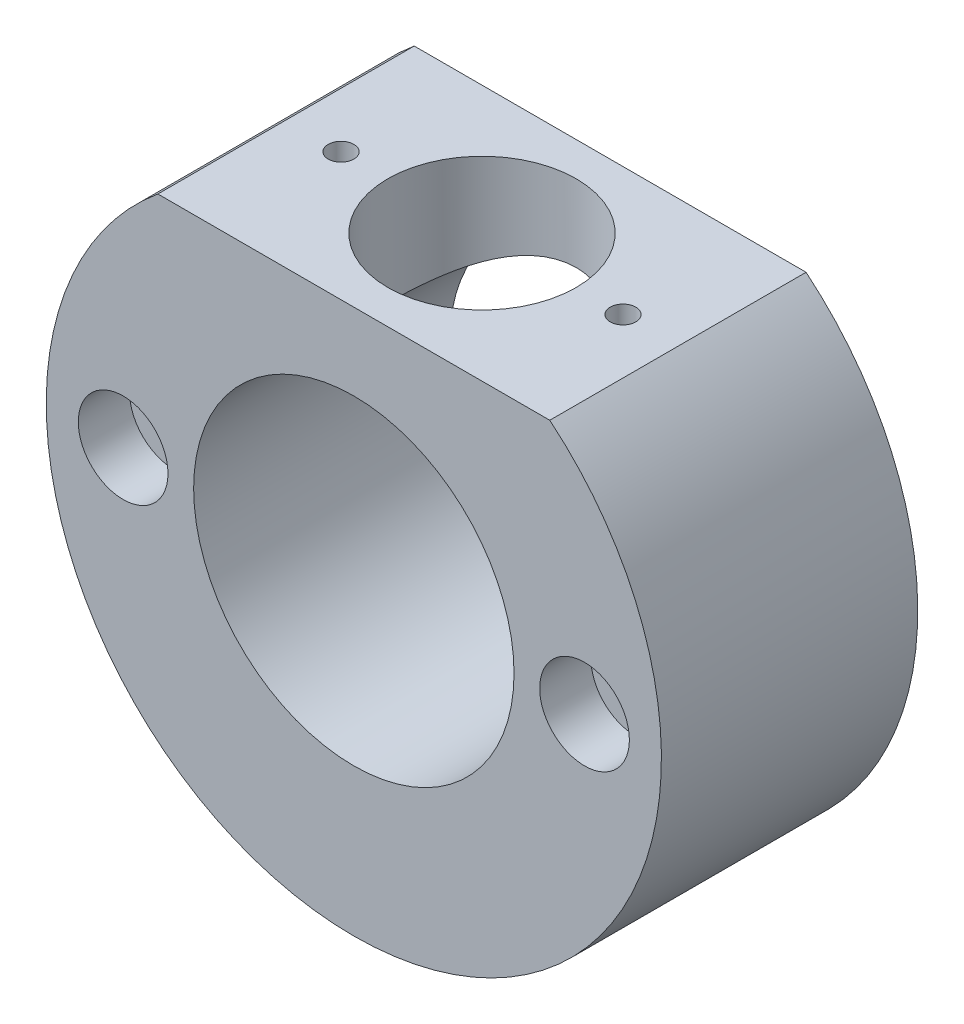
ISO-10303-21;
HEADER;
FILE_DESCRIPTION(('STEP AP214'),'2;1');
FILE_NAME('part.step','',(''),(''),'','','');
FILE_SCHEMA(('AUTOMOTIVE_DESIGN { 1 0 10303 214 1 1 1 1 }'));
ENDSEC;
DATA;
#1=APPLICATION_CONTEXT('core data for automotive mechanical design processes');
#2=APPLICATION_PROTOCOL_DEFINITION('international standard','automotive_design',2000,#1);
#3=PRODUCT_CONTEXT('',#1,'mechanical');
#4=PRODUCT('Part','Part','',(#3));
#5=PRODUCT_RELATED_PRODUCT_CATEGORY('part','',(#4));
#6=PRODUCT_DEFINITION_FORMATION('','',#4);
#7=PRODUCT_DEFINITION_CONTEXT('part definition',#1,'design');
#8=PRODUCT_DEFINITION('design','',#6,#7);
#9=PRODUCT_DEFINITION_SHAPE('','',#8);
#10=(LENGTH_UNIT() NAMED_UNIT(*) SI_UNIT(.MILLI.,.METRE.));
#11=(NAMED_UNIT(*) PLANE_ANGLE_UNIT() SI_UNIT($,.RADIAN.));
#12=(NAMED_UNIT(*) SI_UNIT($,.STERADIAN.) SOLID_ANGLE_UNIT());
#13=UNCERTAINTY_MEASURE_WITH_UNIT(LENGTH_MEASURE(1.E-05),#10,'distance_accuracy_value','');
#14=(GEOMETRIC_REPRESENTATION_CONTEXT(3) GLOBAL_UNCERTAINTY_ASSIGNED_CONTEXT((#13)) GLOBAL_UNIT_ASSIGNED_CONTEXT((#10,
#11,#12)) REPRESENTATION_CONTEXT('',''));
#15=CARTESIAN_POINT('',(0.,0.,0.));
#16=DIRECTION('',(0.,0.,1.));
#17=DIRECTION('',(1.,0.,0.));
#18=AXIS2_PLACEMENT_3D('',#15,#16,#17);
#19=CARTESIAN_POINT('',(0.,0.,20.));
#20=DIRECTION('',(0.,0.,-1.));
#21=DIRECTION('',(-1.,0.,0.));
#22=AXIS2_PLACEMENT_3D('',#19,#20,#21);
#23=CYLINDRICAL_SURFACE('',#22,12.5);
#24=CARTESIAN_POINT('',(0.,0.,0.));
#25=DIRECTION('',(0.,0.,-1.));
#26=DIRECTION('',(-1.,0.,0.));
#27=AXIS2_PLACEMENT_3D('',#24,#25,#26);
#28=CIRCLE('',#27,12.5);
#29=CARTESIAN_POINT('',(-12.5,0.,0.));
#30=VERTEX_POINT('',#29);
#31=EDGE_CURVE('E269',#30,#30,#28,.T.);
#32=ORIENTED_EDGE('',*,*,#31,.T.);
#33=EDGE_LOOP('',(#32));
#34=FACE_BOUND('',#33,.T.);
#35=CARTESIAN_POINT('',(0.,12.5,2.65));
#36=CARTESIAN_POINT('',(-0.188687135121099,12.4999986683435,2.65000145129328));
#37=CARTESIAN_POINT('',(-0.377439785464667,12.4957163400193,2.65727785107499));
#38=CARTESIAN_POINT('',(-0.753530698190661,12.4786886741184,2.68629332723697));
#39=CARTESIAN_POINT('',(-0.940867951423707,12.4659377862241,2.70804188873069));
#40=CARTESIAN_POINT('',(-1.31300012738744,12.4322565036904,2.7657721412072));
#41=CARTESIAN_POINT('',(-1.49778885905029,12.4113089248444,2.80178373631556));
#42=CARTESIAN_POINT('',(-1.86315612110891,12.3617419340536,2.8875891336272));
#43=CARTESIAN_POINT('',(-2.0437328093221,12.333119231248,2.93738884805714));
#44=CARTESIAN_POINT('',(-2.39847109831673,12.2690519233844,3.04987317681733));
#45=CARTESIAN_POINT('',(-2.57266217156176,12.2336451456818,3.11248646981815));
#46=CARTESIAN_POINT('',(-2.91470298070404,12.1566976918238,3.25010821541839));
#47=CARTESIAN_POINT('',(-3.08255023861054,12.1151546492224,3.32512145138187));
#48=CARTESIAN_POINT('',(-3.57501678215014,11.982673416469,3.56762837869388));
#49=CARTESIAN_POINT('',(-3.88903345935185,11.8837941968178,3.75274114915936));
#50=CARTESIAN_POINT('',(-4.50542331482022,11.6647448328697,4.17978724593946));
#51=CARTESIAN_POINT('',(-4.80517136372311,11.5435356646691,4.42493367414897));
#52=CARTESIAN_POINT('',(-5.36201152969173,11.2956497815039,4.95817450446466));
#53=CARTESIAN_POINT('',(-5.6190494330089,11.1689663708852,5.24632262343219));
#54=CARTESIAN_POINT('',(-5.98273049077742,10.9762838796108,5.72496735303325));
#55=CARTESIAN_POINT('',(-6.10569416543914,10.908170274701,5.90245906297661));
#56=CARTESIAN_POINT('',(-6.33616392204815,10.7759291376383,6.2687372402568));
#57=CARTESIAN_POINT('',(-6.44366760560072,10.7118022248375,6.45752545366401));
#58=CARTESIAN_POINT('',(-6.64209900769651,10.589904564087,6.8452577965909));
#59=CARTESIAN_POINT('',(-6.73304791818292,10.5321257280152,7.04418851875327));
#60=CARTESIAN_POINT('',(-6.89746900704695,10.4251882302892,7.45135797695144));
#61=CARTESIAN_POINT('',(-6.97094737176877,10.3760265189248,7.65959338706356));
#62=CARTESIAN_POINT('',(-7.08435616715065,10.2988077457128,8.03446871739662));
#63=CARTESIAN_POINT('',(-7.12811421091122,10.2685022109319,8.19949640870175));
#64=CARTESIAN_POINT('',(-7.20420972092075,10.2152594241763,8.53331967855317));
#65=CARTESIAN_POINT('',(-7.23654960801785,10.1923206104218,8.7021144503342));
#66=CARTESIAN_POINT('',(-7.28936834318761,10.1546130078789,9.04229079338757));
#67=CARTESIAN_POINT('',(-7.30985864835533,10.1398363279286,9.21366970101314));
#68=CARTESIAN_POINT('',(-7.33873028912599,10.1189603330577,9.55798094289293));
#69=CARTESIAN_POINT('',(-7.34711140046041,10.1128611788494,9.73091330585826));
#70=CARTESIAN_POINT('',(-7.35163767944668,10.1095713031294,10.077317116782));
#71=CARTESIAN_POINT('',(-7.34776210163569,10.1123956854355,10.2507889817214));
#72=CARTESIAN_POINT('',(-7.32779047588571,10.1268769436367,10.5966521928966));
#73=CARTESIAN_POINT('',(-7.31169437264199,10.138533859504,10.769043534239));
#74=CARTESIAN_POINT('',(-7.26751374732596,10.1702497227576,11.1115655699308));
#75=CARTESIAN_POINT('',(-7.2394241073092,10.1903122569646,11.2816952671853));
#76=CARTESIAN_POINT('',(-7.1716274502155,10.2381383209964,11.6185793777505));
#77=CARTESIAN_POINT('',(-7.13191570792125,10.2659049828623,11.7853323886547));
#78=CARTESIAN_POINT('',(-7.0417751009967,10.3279409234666,12.1129353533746));
#79=CARTESIAN_POINT('',(-6.99144988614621,10.3621469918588,12.2738259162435));
#80=CARTESIAN_POINT('',(-6.8803556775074,10.4362426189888,12.5906381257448));
#81=CARTESIAN_POINT('',(-6.81958326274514,10.476134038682,12.7465581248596));
#82=CARTESIAN_POINT('',(-6.62235706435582,10.6027737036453,13.205915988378));
#83=CARTESIAN_POINT('',(-6.47094919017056,10.6965197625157,13.501113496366));
#84=CARTESIAN_POINT('',(-6.10314538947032,10.9111915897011,14.1136916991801));
#85=CARTESIAN_POINT('',(-5.88009380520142,11.0340342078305,14.4264068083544));
#86=CARTESIAN_POINT('',(-5.5117682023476,11.2200472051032,14.8661642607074));
#87=CARTESIAN_POINT('',(-5.38325760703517,11.2823911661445,15.0079609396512));
#88=CARTESIAN_POINT('',(-5.11534440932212,11.4063583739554,15.2813225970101));
#89=CARTESIAN_POINT('',(-4.9759399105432,11.4679814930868,15.4128857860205));
#90=CARTESIAN_POINT('',(-4.66815520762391,11.5969667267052,15.6813487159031));
#91=CARTESIAN_POINT('',(-4.49835426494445,11.6640476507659,15.8167586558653));
#92=CARTESIAN_POINT('',(-4.14637317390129,11.7937588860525,16.0726773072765));
#93=CARTESIAN_POINT('',(-3.96419797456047,11.8563909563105,16.193191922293));
#94=CARTESIAN_POINT('',(-3.58835823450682,11.9754972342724,16.4182669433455));
#95=CARTESIAN_POINT('',(-3.39469559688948,12.0319724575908,16.5228299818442));
#96=CARTESIAN_POINT('',(-2.9970371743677,12.1371349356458,16.7148341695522));
#97=CARTESIAN_POINT('',(-2.79304268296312,12.1858231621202,16.8022774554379));
#98=CARTESIAN_POINT('',(-2.38996605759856,12.2710085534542,16.9536898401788));
#99=CARTESIAN_POINT('',(-2.19144852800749,12.3080983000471,17.0188274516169));
#100=CARTESIAN_POINT('',(-1.78817440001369,12.373121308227,17.1322361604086));
#101=CARTESIAN_POINT('',(-1.58341800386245,12.4010548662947,17.1805078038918));
#102=CARTESIAN_POINT('',(-1.16961672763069,12.4468987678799,17.2593952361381));
#103=CARTESIAN_POINT('',(-0.960575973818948,12.464818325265,17.290027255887));
#104=CARTESIAN_POINT('',(-0.540008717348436,12.4901059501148,17.3331818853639));
#105=CARTESIAN_POINT('',(-0.328482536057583,12.4974753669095,17.3457068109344));
#106=CARTESIAN_POINT('',(0.067433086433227,12.501176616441,17.3520006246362));
#107=CARTESIAN_POINT('',(0.251779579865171,12.4988174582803,17.3479938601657));
#108=CARTESIAN_POINT('',(0.619370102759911,12.4859998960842,17.3261704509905));
#109=CARTESIAN_POINT('',(0.802614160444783,12.4755417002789,17.3083541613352));
#110=CARTESIAN_POINT('',(1.16662778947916,12.4467793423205,17.2591468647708));
#111=CARTESIAN_POINT('',(1.34739750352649,12.4284756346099,17.2277566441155));
#112=CARTESIAN_POINT('',(1.70522100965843,12.3844548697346,17.1517955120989));
#113=CARTESIAN_POINT('',(1.8822746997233,12.358737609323,17.1072242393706));
#114=CARTESIAN_POINT('',(2.22833866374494,12.3010042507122,17.0063461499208));
#115=CARTESIAN_POINT('',(2.39743690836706,12.2691123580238,16.9502696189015));
#116=CARTESIAN_POINT('',(2.73007749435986,12.1994101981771,16.826471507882));
#117=CARTESIAN_POINT('',(2.89361799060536,12.1615979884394,16.7587461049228));
#118=CARTESIAN_POINT('',(3.37460731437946,12.0403933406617,16.5390061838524));
#119=CARTESIAN_POINT('',(3.68267291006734,11.9491897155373,16.3703544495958));
#120=CARTESIAN_POINT('',(4.29899241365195,11.7424565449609,15.9740528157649));
#121=CARTESIAN_POINT('',(4.60391798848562,11.625382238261,15.7420853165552));
#122=CARTESIAN_POINT('',(5.17302246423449,11.3835602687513,15.2352292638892));
#123=CARTESIAN_POINT('',(5.43715314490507,11.2588037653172,14.9602906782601));
#124=CARTESIAN_POINT('',(5.81429221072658,11.0664942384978,14.5013539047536));
#125=CARTESIAN_POINT('',(5.94280069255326,10.9978325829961,14.3303057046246));
#126=CARTESIAN_POINT('',(6.18495531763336,10.8634924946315,13.9767716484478));
#127=CARTESIAN_POINT('',(6.29859916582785,10.7978145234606,13.7942840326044));
#128=CARTESIAN_POINT('',(6.5100145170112,10.6716851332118,13.4188578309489));
#129=CARTESIAN_POINT('',(6.60780085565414,10.6112288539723,13.2259292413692));
#130=CARTESIAN_POINT('',(6.78663914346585,10.4977497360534,12.8303878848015));
#131=CARTESIAN_POINT('',(6.86769648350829,10.4447245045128,12.6277782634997));
#132=CARTESIAN_POINT('',(6.99643516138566,10.3587897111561,12.2587422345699));
#133=CARTESIAN_POINT('',(7.04754429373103,10.324008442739,12.0939408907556));
#134=CARTESIAN_POINT('',(7.13826833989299,10.2614893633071,11.7599817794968));
#135=CARTESIAN_POINT('',(7.17789024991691,10.2337472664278,11.590826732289));
#136=CARTESIAN_POINT('',(7.24515709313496,10.1862357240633,11.249191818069));
#137=CARTESIAN_POINT('',(7.27281231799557,10.1664594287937,11.076714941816));
#138=CARTESIAN_POINT('',(7.31580523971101,10.1355660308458,10.7294516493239));
#139=CARTESIAN_POINT('',(7.33114281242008,10.1244490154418,10.5546652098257));
#140=CARTESIAN_POINT('',(7.34928901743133,10.1112847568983,10.2035706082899));
#141=CARTESIAN_POINT('',(7.35205990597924,10.1092648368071,10.027259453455));
#142=CARTESIAN_POINT('',(7.34492513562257,10.1144497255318,9.67503148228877));
#143=CARTESIAN_POINT('',(7.33501943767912,10.1216545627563,9.4991146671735));
#144=CARTESIAN_POINT('',(7.30268112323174,10.1450107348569,9.14895253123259));
#145=CARTESIAN_POINT('',(7.2802420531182,10.1611666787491,8.97470811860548));
#146=CARTESIAN_POINT('',(7.22316722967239,10.2018173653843,8.62922861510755));
#147=CARTESIAN_POINT('',(7.1885313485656,10.226312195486,8.45799355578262));
#148=CARTESIAN_POINT('',(7.10892963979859,10.2817987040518,8.12548105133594));
#149=CARTESIAN_POINT('',(7.06436480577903,10.3125349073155,7.96406438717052));
#150=CARTESIAN_POINT('',(6.96476304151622,10.3800621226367,7.64576797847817));
#151=CARTESIAN_POINT('',(6.90972255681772,10.4168551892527,7.48888979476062));
#152=CARTESIAN_POINT('',(6.72963173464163,10.5348318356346,7.02610005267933));
#153=CARTESIAN_POINT('',(6.58957090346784,10.6236428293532,6.72786417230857));
#154=CARTESIAN_POINT('',(6.24849643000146,10.8282753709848,6.11136647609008));
#155=CARTESIAN_POINT('',(6.04140226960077,10.9461499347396,5.79715665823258));
#156=CARTESIAN_POINT('',(5.6977843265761,11.1266392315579,5.35318958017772));
#157=CARTESIAN_POINT('',(5.57765462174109,11.1874584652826,5.20966895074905));
#158=CARTESIAN_POINT('',(5.32675106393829,11.3090731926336,4.93213970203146));
#159=CARTESIAN_POINT('',(5.19597550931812,11.3698686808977,4.7981326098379));
#160=CARTESIAN_POINT('',(4.90428346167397,11.4990019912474,4.52125280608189));
#161=CARTESIAN_POINT('',(4.74176190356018,11.5671351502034,4.37997159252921));
#162=CARTESIAN_POINT('',(4.40410499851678,11.6998611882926,4.11163500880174));
#163=CARTESIAN_POINT('',(4.22897380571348,11.7644552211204,3.98457498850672));
#164=CARTESIAN_POINT('',(3.86674763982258,11.8884366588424,3.74557194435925));
#165=CARTESIAN_POINT('',(3.67964507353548,11.9478207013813,3.63363865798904));
#166=CARTESIAN_POINT('',(3.29461831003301,12.0596708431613,3.42612756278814));
#167=CARTESIAN_POINT('',(3.09669566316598,12.1121379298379,3.33054741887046));
#168=CARTESIAN_POINT('',(2.70000728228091,12.2065444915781,3.16062863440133));
#169=CARTESIAN_POINT('',(2.50164144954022,12.2488388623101,3.08555502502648));
#170=CARTESIAN_POINT('',(2.0976217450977,12.3244551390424,2.9524688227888));
#171=CARTESIAN_POINT('',(1.89196925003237,12.3577787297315,2.89445302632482));
#172=CARTESIAN_POINT('',(1.47575528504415,12.4143514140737,2.79651374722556));
#173=CARTESIAN_POINT('',(1.26521176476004,12.4376326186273,2.75653257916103));
#174=CARTESIAN_POINT('',(0.840662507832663,12.473515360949,2.69508972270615));
#175=CARTESIAN_POINT('',(0.626659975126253,12.486126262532,2.67361179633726));
#176=CARTESIAN_POINT('',(0.343464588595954,12.4954695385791,2.65770728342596));
#177=CARTESIAN_POINT('',(0.27481817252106,12.4971674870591,2.65481810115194));
#178=CARTESIAN_POINT('',(0.137450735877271,12.4994329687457,2.65096418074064));
#179=CARTESIAN_POINT('',(0.0687297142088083,12.5000004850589,2.64999947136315));
#180=CARTESIAN_POINT('',(0.,12.5,2.65));
#181=B_SPLINE_CURVE_WITH_KNOTS('',3,(#35,#36,#37,#38,#39,#40,#41,#42,#43,#44,#45,#46,#47,#48,
#49,#50,#51,#52,#53,#54,#55,#56,#57,#58,#59,#60,#61,#62,#63,#64,#65,#66,#67,#68,#69,#70,#71,#72,
#73,#74,#75,#76,#77,#78,#79,#80,#81,#82,#83,#84,#85,#86,#87,#88,#89,#90,#91,#92,#93,#94,#95,#96,
#97,#98,#99,#100,#101,#102,#103,#104,#105,#106,#107,#108,#109,#110,#111,#112,#113,#114,#115,
#116,#117,#118,#119,#120,#121,#122,#123,#124,#125,#126,#127,#128,#129,#130,#131,#132,#133,#134,
#135,#136,#137,#138,#139,#140,#141,#142,#143,#144,#145,#146,#147,#148,#149,#150,#151,#152,#153,
#154,#155,#156,#157,#158,#159,#160,#161,#162,#163,#164,#165,#166,#167,#168,#169,#170,#171,#172,
#173,#174,#175,#176,#177,#178,#179,#180),.UNSPECIFIED.,.T.,.F.,(4,2,2,2,2,2,2,2,2,2,2,2,2,2,2,2,
2,2,2,2,2,2,2,2,2,2,2,2,2,2,2,2,2,2,2,2,2,2,2,2,2,2,2,2,2,2,2,2,2,2,2,2,2,2,2,2,2,2,2,2,2,2,2,2,
2,2,2,2,2,2,2,2,4),(0.,0.565987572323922,1.13234646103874,1.69989912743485,2.26769553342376,
2.83241354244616,3.39734990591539,4.52572664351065,5.73845320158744,6.9527075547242,
7.63124396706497,8.30988553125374,8.98765215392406,9.66517841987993,10.1848522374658,
10.7044158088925,11.223476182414,11.7425461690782,12.2624951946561,12.7824465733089,
13.3026200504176,13.8230053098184,14.3385261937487,14.8542162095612,15.8850880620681,
17.0899566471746,17.6933100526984,18.2967687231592,18.9778384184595,19.6586373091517,
20.3393237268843,21.0199251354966,21.6556000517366,22.2912543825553,22.9263228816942,
23.5613101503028,24.1138419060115,24.6663594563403,25.2188450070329,25.7713457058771,
26.3137108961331,26.8562544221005,27.9405605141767,29.1379036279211,30.3366513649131,
31.0100553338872,31.6835631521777,32.3564371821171,33.0290940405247,33.5566185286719,
34.0838210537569,34.6105692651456,35.1373227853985,35.6656573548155,36.1939935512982,
36.7226020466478,37.2512160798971,37.7614523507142,38.2718620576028,39.2921568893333,
40.4704691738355,41.0604398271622,41.6505049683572,42.3272900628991,43.00385320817,
43.6808498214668,44.3577496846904,45.0056305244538,45.6533896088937,46.2990618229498,
46.9441668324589,47.1503260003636,47.356488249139),.UNSPECIFIED.);
#182=CARTESIAN_POINT('',(0.,12.5,2.65));
#183=VERTEX_POINT('',#182);
#184=EDGE_CURVE('E18',#183,#183,#181,.T.);
#185=ORIENTED_EDGE('',*,*,#184,.T.);
#186=EDGE_LOOP('',(#185));
#187=FACE_BOUND('',#186,.T.);
#188=CARTESIAN_POINT('',(0.,0.,20.));
#189=DIRECTION('',(0.,0.,1.));
#190=DIRECTION('',(1.,0.,0.));
#191=AXIS2_PLACEMENT_3D('',#188,#189,#190);
#192=CIRCLE('',#191,12.5);
#193=CARTESIAN_POINT('',(12.5,0.,20.));
#194=VERTEX_POINT('',#193);
#195=EDGE_CURVE('E66',#194,#194,#192,.T.);
#196=ORIENTED_EDGE('',*,*,#195,.T.);
#197=EDGE_LOOP('',(#196));
#198=FACE_BOUND('',#197,.T.);
#199=ADVANCED_FACE('F14',(#34,#187,#198),#23,.F.);
#200=CARTESIAN_POINT('',(0.,0.,20.));
#201=DIRECTION('',(0.,0.,1.));
#202=DIRECTION('',(1.,0.,0.));
#203=AXIS2_PLACEMENT_3D('',#200,#201,#202);
#204=PLANE('',#203);
#205=CARTESIAN_POINT('',(-18.,0.,20.));
#206=DIRECTION('',(0.,0.,1.));
#207=DIRECTION('',(1.,0.,0.));
#208=AXIS2_PLACEMENT_3D('',#205,#206,#207);
#209=CIRCLE('',#208,3.5);
#210=CARTESIAN_POINT('',(-14.5,0.,20.));
#211=VERTEX_POINT('',#210);
#212=EDGE_CURVE('E69',#211,#211,#209,.T.);
#213=ORIENTED_EDGE('',*,*,#212,.F.);
#214=EDGE_LOOP('',(#213));
#215=FACE_BOUND('',#214,.T.);
#216=ORIENTED_EDGE('',*,*,#195,.F.);
#217=EDGE_LOOP('',(#216));
#218=FACE_BOUND('',#217,.T.);
#219=CARTESIAN_POINT('',(18.,0.,20.));
#220=DIRECTION('',(0.,0.,1.));
#221=DIRECTION('',(1.,0.,0.));
#222=AXIS2_PLACEMENT_3D('',#219,#220,#221);
#223=CIRCLE('',#222,3.5);
#224=CARTESIAN_POINT('',(21.5,0.,20.));
#225=VERTEX_POINT('',#224);
#226=EDGE_CURVE('E63',#225,#225,#223,.T.);
#227=ORIENTED_EDGE('',*,*,#226,.F.);
#228=EDGE_LOOP('',(#227));
#229=FACE_BOUND('',#228,.T.);
#230=DIRECTION('',(1.,0.,0.));
#231=VECTOR('',#230,1.);
#232=CARTESIAN_POINT('',(0.,18.5,20.));
#233=LINE('',#232,#231);
#234=CARTESIAN_POINT('',(-15.2888848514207,18.5,20.));
#235=VERTEX_POINT('',#234);
#236=CARTESIAN_POINT('',(15.2888848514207,18.5,20.));
#237=VERTEX_POINT('',#236);
#238=EDGE_CURVE('E49',#235,#237,#233,.T.);
#239=ORIENTED_EDGE('',*,*,#238,.F.);
#240=CARTESIAN_POINT('',(0.,0.,20.));
#241=DIRECTION('',(0.,0.,1.));
#242=DIRECTION('',(1.,0.,0.));
#243=AXIS2_PLACEMENT_3D('',#240,#241,#242);
#244=CIRCLE('',#243,24.);
#245=EDGE_CURVE('E58',#235,#237,#244,.T.);
#246=ORIENTED_EDGE('',*,*,#245,.T.);
#247=EDGE_LOOP('',(#239,#246));
#248=FACE_BOUND('',#247,.T.);
#249=ADVANCED_FACE('F106',(#215,#218,#229,#248),#204,.T.);
#250=CARTESIAN_POINT('',(0.,0.,0.));
#251=DIRECTION('',(0.,0.,1.));
#252=DIRECTION('',(1.,0.,0.));
#253=AXIS2_PLACEMENT_3D('',#250,#251,#252);
#254=PLANE('',#253);
#255=DIRECTION('',(-1.,0.,0.));
#256=VECTOR('',#255,1.);
#257=CARTESIAN_POINT('',(0.,18.5,0.));
#258=LINE('',#257,#256);
#259=CARTESIAN_POINT('',(15.2888848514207,18.5,0.));
#260=VERTEX_POINT('',#259);
#261=CARTESIAN_POINT('',(-15.2888848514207,18.5,0.));
#262=VERTEX_POINT('',#261);
#263=EDGE_CURVE('E47',#260,#262,#258,.T.);
#264=ORIENTED_EDGE('',*,*,#263,.F.);
#265=CARTESIAN_POINT('',(0.,0.,0.));
#266=DIRECTION('',(0.,0.,-1.));
#267=DIRECTION('',(-1.,0.,0.));
#268=AXIS2_PLACEMENT_3D('',#265,#266,#267);
#269=CIRCLE('',#268,24.);
#270=EDGE_CURVE('E54',#260,#262,#269,.T.);
#271=ORIENTED_EDGE('',*,*,#270,.T.);
#272=EDGE_LOOP('',(#264,#271));
#273=FACE_BOUND('',#272,.T.);
#274=CARTESIAN_POINT('',(18.,0.,0.));
#275=DIRECTION('',(0.,0.,-1.));
#276=DIRECTION('',(-1.,0.,0.));
#277=AXIS2_PLACEMENT_3D('',#274,#275,#276);
#278=CIRCLE('',#277,1.75);
#279=CARTESIAN_POINT('',(16.25,0.,0.));
#280=VERTEX_POINT('',#279);
#281=EDGE_CURVE('E55',#280,#280,#278,.T.);
#282=ORIENTED_EDGE('',*,*,#281,.F.);
#283=EDGE_LOOP('',(#282));
#284=FACE_BOUND('',#283,.T.);
#285=CARTESIAN_POINT('',(-18.,0.,0.));
#286=DIRECTION('',(0.,0.,-1.));
#287=DIRECTION('',(-1.,0.,0.));
#288=AXIS2_PLACEMENT_3D('',#285,#286,#287);
#289=CIRCLE('',#288,1.75);
#290=CARTESIAN_POINT('',(-19.75,0.,0.));
#291=VERTEX_POINT('',#290);
#292=EDGE_CURVE('E271',#291,#291,#289,.T.);
#293=ORIENTED_EDGE('',*,*,#292,.F.);
#294=EDGE_LOOP('',(#293));
#295=FACE_BOUND('',#294,.T.);
#296=ORIENTED_EDGE('',*,*,#31,.F.);
#297=EDGE_LOOP('',(#296));
#298=FACE_BOUND('',#297,.T.);
#299=ADVANCED_FACE('F52',(#273,#284,#295,#298),#254,.F.);
#300=CARTESIAN_POINT('',(0.,0.,20.));
#301=DIRECTION('',(0.,0.,-1.));
#302=DIRECTION('',(-1.,0.,0.));
#303=AXIS2_PLACEMENT_3D('',#300,#301,#302);
#304=CYLINDRICAL_SURFACE('',#303,24.);
#305=ORIENTED_EDGE('',*,*,#270,.F.);
#306=DIRECTION('',(0.,0.,-1.));
#307=VECTOR('',#306,1.);
#308=CARTESIAN_POINT('',(15.2888848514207,18.5,20.));
#309=LINE('',#308,#307);
#310=EDGE_CURVE('E9',#237,#260,#309,.T.);
#311=ORIENTED_EDGE('',*,*,#310,.F.);
#312=ORIENTED_EDGE('',*,*,#245,.F.);
#313=DIRECTION('',(0.,0.,-1.));
#314=VECTOR('',#313,1.);
#315=CARTESIAN_POINT('',(-15.2888848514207,18.5,20.));
#316=LINE('',#315,#314);
#317=EDGE_CURVE('E28',#235,#262,#316,.T.);
#318=ORIENTED_EDGE('',*,*,#317,.T.);
#319=EDGE_LOOP('',(#305,#311,#312,#318));
#320=FACE_BOUND('',#319,.T.);
#321=ADVANCED_FACE('F16',(#320),#304,.T.);
#322=CARTESIAN_POINT('',(-15.2888848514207,18.5,20.));
#323=DIRECTION('',(0.,-1.,0.));
#324=DIRECTION('',(0.,0.,-1.));
#325=AXIS2_PLACEMENT_3D('',#322,#323,#324);
#326=PLANE('',#325);
#327=CARTESIAN_POINT('',(11.,18.5,10.));
#328=DIRECTION('',(0.,1.,0.));
#329=DIRECTION('',(0.,0.,1.));
#330=AXIS2_PLACEMENT_3D('',#327,#328,#329);
#331=CIRCLE('',#330,1.);
#332=CARTESIAN_POINT('',(11.,18.5,11.));
#333=VERTEX_POINT('',#332);
#334=EDGE_CURVE('E257',#333,#333,#331,.T.);
#335=ORIENTED_EDGE('',*,*,#334,.F.);
#336=EDGE_LOOP('',(#335));
#337=FACE_BOUND('',#336,.T.);
#338=CARTESIAN_POINT('',(-11.,18.5,10.));
#339=DIRECTION('',(0.,1.,0.));
#340=DIRECTION('',(0.,0.,1.));
#341=AXIS2_PLACEMENT_3D('',#338,#339,#340);
#342=CIRCLE('',#341,1.);
#343=CARTESIAN_POINT('',(-11.,18.5,11.));
#344=VERTEX_POINT('',#343);
#345=EDGE_CURVE('E259',#344,#344,#342,.T.);
#346=ORIENTED_EDGE('',*,*,#345,.F.);
#347=EDGE_LOOP('',(#346));
#348=FACE_BOUND('',#347,.T.);
#349=ORIENTED_EDGE('',*,*,#263,.T.);
#350=ORIENTED_EDGE('',*,*,#317,.F.);
#351=ORIENTED_EDGE('',*,*,#238,.T.);
#352=ORIENTED_EDGE('',*,*,#310,.T.);
#353=EDGE_LOOP('',(#349,#350,#351,#352));
#354=FACE_BOUND('',#353,.T.);
#355=CARTESIAN_POINT('',(0.,18.5,10.));
#356=DIRECTION('',(0.,1.,0.));
#357=DIRECTION('',(0.,0.,1.));
#358=AXIS2_PLACEMENT_3D('',#355,#356,#357);
#359=CIRCLE('',#358,7.35);
#360=CARTESIAN_POINT('',(0.,18.5,17.35));
#361=VERTEX_POINT('',#360);
#362=EDGE_CURVE('E265',#361,#361,#359,.T.);
#363=ORIENTED_EDGE('',*,*,#362,.F.);
#364=EDGE_LOOP('',(#363));
#365=FACE_BOUND('',#364,.T.);
#366=ADVANCED_FACE('F45',(#337,#348,#354,#365),#326,.F.);
#367=CARTESIAN_POINT('',(0.,18.5,10.));
#368=DIRECTION('',(0.,-1.,0.));
#369=DIRECTION('',(0.,0.,-1.));
#370=AXIS2_PLACEMENT_3D('',#367,#368,#369);
#371=CYLINDRICAL_SURFACE('',#370,7.35);
#372=ORIENTED_EDGE('',*,*,#362,.T.);
#373=EDGE_LOOP('',(#372));
#374=FACE_BOUND('',#373,.T.);
#375=ORIENTED_EDGE('',*,*,#184,.F.);
#376=EDGE_LOOP('',(#375));
#377=FACE_BOUND('',#376,.T.);
#378=ADVANCED_FACE('F89',(#374,#377),#371,.F.);
#379=CARTESIAN_POINT('',(-18.,0.,20.));
#380=DIRECTION('',(0.,0.,1.));
#381=DIRECTION('',(1.,0.,0.));
#382=AXIS2_PLACEMENT_3D('',#379,#380,#381);
#383=CYLINDRICAL_SURFACE('',#382,1.75);
#384=CARTESIAN_POINT('',(-18.,0.,16.));
#385=DIRECTION('',(0.,0.,1.));
#386=DIRECTION('',(1.,0.,0.));
#387=AXIS2_PLACEMENT_3D('',#384,#385,#386);
#388=CIRCLE('',#387,1.75);
#389=CARTESIAN_POINT('',(-16.25,0.,16.));
#390=VERTEX_POINT('',#389);
#391=EDGE_CURVE('E81',#390,#390,#388,.T.);
#392=ORIENTED_EDGE('',*,*,#391,.T.);
#393=EDGE_LOOP('',(#392));
#394=FACE_BOUND('',#393,.T.);
#395=ORIENTED_EDGE('',*,*,#292,.T.);
#396=EDGE_LOOP('',(#395));
#397=FACE_BOUND('',#396,.T.);
#398=ADVANCED_FACE('F91',(#394,#397),#383,.F.);
#399=CARTESIAN_POINT('',(-14.5,0.,16.));
#400=DIRECTION('',(0.,0.,-1.));
#401=DIRECTION('',(-1.,0.,0.));
#402=AXIS2_PLACEMENT_3D('',#399,#400,#401);
#403=PLANE('',#402);
#404=ORIENTED_EDGE('',*,*,#391,.F.);
#405=EDGE_LOOP('',(#404));
#406=FACE_BOUND('',#405,.T.);
#407=CARTESIAN_POINT('',(-18.,0.,16.));
#408=DIRECTION('',(0.,0.,1.));
#409=DIRECTION('',(1.,0.,0.));
#410=AXIS2_PLACEMENT_3D('',#407,#408,#409);
#411=CIRCLE('',#410,3.5);
#412=CARTESIAN_POINT('',(-14.5,0.,16.));
#413=VERTEX_POINT('',#412);
#414=EDGE_CURVE('E78',#413,#413,#411,.T.);
#415=ORIENTED_EDGE('',*,*,#414,.T.);
#416=EDGE_LOOP('',(#415));
#417=FACE_BOUND('',#416,.T.);
#418=ADVANCED_FACE('F99',(#406,#417),#403,.F.);
#419=CARTESIAN_POINT('',(-18.,0.,20.));
#420=DIRECTION('',(0.,0.,1.));
#421=DIRECTION('',(1.,0.,0.));
#422=AXIS2_PLACEMENT_3D('',#419,#420,#421);
#423=CYLINDRICAL_SURFACE('',#422,3.5);
#424=ORIENTED_EDGE('',*,*,#212,.T.);
#425=EDGE_LOOP('',(#424));
#426=FACE_BOUND('',#425,.T.);
#427=ORIENTED_EDGE('',*,*,#414,.F.);
#428=EDGE_LOOP('',(#427));
#429=FACE_BOUND('',#428,.T.);
#430=ADVANCED_FACE('F168',(#426,#429),#423,.F.);
#431=CARTESIAN_POINT('',(18.,0.,20.));
#432=DIRECTION('',(0.,0.,1.));
#433=DIRECTION('',(1.,0.,0.));
#434=AXIS2_PLACEMENT_3D('',#431,#432,#433);
#435=CYLINDRICAL_SURFACE('',#434,1.75);
#436=CARTESIAN_POINT('',(18.,0.,16.));
#437=DIRECTION('',(0.,0.,1.));
#438=DIRECTION('',(1.,0.,0.));
#439=AXIS2_PLACEMENT_3D('',#436,#437,#438);
#440=CIRCLE('',#439,1.75);
#441=CARTESIAN_POINT('',(19.75,0.,16.));
#442=VERTEX_POINT('',#441);
#443=EDGE_CURVE('E75',#442,#442,#440,.T.);
#444=ORIENTED_EDGE('',*,*,#443,.T.);
#445=EDGE_LOOP('',(#444));
#446=FACE_BOUND('',#445,.T.);
#447=ORIENTED_EDGE('',*,*,#281,.T.);
#448=EDGE_LOOP('',(#447));
#449=FACE_BOUND('',#448,.T.);
#450=ADVANCED_FACE('F176',(#446,#449),#435,.F.);
#451=CARTESIAN_POINT('',(21.5,0.,16.));
#452=DIRECTION('',(0.,0.,-1.));
#453=DIRECTION('',(-1.,0.,0.));
#454=AXIS2_PLACEMENT_3D('',#451,#452,#453);
#455=PLANE('',#454);
#456=ORIENTED_EDGE('',*,*,#443,.F.);
#457=EDGE_LOOP('',(#456));
#458=FACE_BOUND('',#457,.T.);
#459=CARTESIAN_POINT('',(18.,0.,16.));
#460=DIRECTION('',(0.,0.,1.));
#461=DIRECTION('',(1.,0.,0.));
#462=AXIS2_PLACEMENT_3D('',#459,#460,#461);
#463=CIRCLE('',#462,3.5);
#464=CARTESIAN_POINT('',(21.5,0.,16.));
#465=VERTEX_POINT('',#464);
#466=EDGE_CURVE('E72',#465,#465,#463,.T.);
#467=ORIENTED_EDGE('',*,*,#466,.T.);
#468=EDGE_LOOP('',(#467));
#469=FACE_BOUND('',#468,.T.);
#470=ADVANCED_FACE('F185',(#458,#469),#455,.F.);
#471=CARTESIAN_POINT('',(18.,0.,20.));
#472=DIRECTION('',(0.,0.,1.));
#473=DIRECTION('',(1.,0.,0.));
#474=AXIS2_PLACEMENT_3D('',#471,#472,#473);
#475=CYLINDRICAL_SURFACE('',#474,3.5);
#476=ORIENTED_EDGE('',*,*,#226,.T.);
#477=EDGE_LOOP('',(#476));
#478=FACE_BOUND('',#477,.T.);
#479=ORIENTED_EDGE('',*,*,#466,.F.);
#480=EDGE_LOOP('',(#479));
#481=FACE_BOUND('',#480,.T.);
#482=ADVANCED_FACE('F194',(#478,#481),#475,.F.);
#483=CARTESIAN_POINT('',(-11.,14.5,10.));
#484=DIRECTION('',(0.,1.,0.));
#485=DIRECTION('',(0.,0.,1.));
#486=AXIS2_PLACEMENT_3D('',#483,#484,#485);
#487=PLANE('',#486);
#488=CARTESIAN_POINT('',(-11.,14.5,10.));
#489=DIRECTION('',(0.,1.,0.));
#490=DIRECTION('',(0.,0.,1.));
#491=AXIS2_PLACEMENT_3D('',#488,#489,#490);
#492=CIRCLE('',#491,1.);
#493=CARTESIAN_POINT('',(-11.,14.5,11.));
#494=VERTEX_POINT('',#493);
#495=EDGE_CURVE('E262',#494,#494,#492,.T.);
#496=ORIENTED_EDGE('',*,*,#495,.T.);
#497=EDGE_LOOP('',(#496));
#498=FACE_BOUND('',#497,.T.);
#499=ADVANCED_FACE('F203',(#498),#487,.T.);
#500=CARTESIAN_POINT('',(-11.,14.5,10.));
#501=DIRECTION('',(0.,1.,0.));
#502=DIRECTION('',(0.,0.,1.));
#503=AXIS2_PLACEMENT_3D('',#500,#501,#502);
#504=CYLINDRICAL_SURFACE('',#503,1.);
#505=ORIENTED_EDGE('',*,*,#495,.F.);
#506=EDGE_LOOP('',(#505));
#507=FACE_BOUND('',#506,.T.);
#508=ORIENTED_EDGE('',*,*,#345,.T.);
#509=EDGE_LOOP('',(#508));
#510=FACE_BOUND('',#509,.T.);
#511=ADVANCED_FACE('F212',(#507,#510),#504,.F.);
#512=CARTESIAN_POINT('',(11.,14.5,10.));
#513=DIRECTION('',(0.,1.,0.));
#514=DIRECTION('',(0.,0.,1.));
#515=AXIS2_PLACEMENT_3D('',#512,#513,#514);
#516=PLANE('',#515);
#517=CARTESIAN_POINT('',(11.,14.5,10.));
#518=DIRECTION('',(0.,1.,0.));
#519=DIRECTION('',(0.,0.,1.));
#520=AXIS2_PLACEMENT_3D('',#517,#518,#519);
#521=CIRCLE('',#520,1.);
#522=CARTESIAN_POINT('',(11.,14.5,11.));
#523=VERTEX_POINT('',#522);
#524=EDGE_CURVE('E254',#523,#523,#521,.T.);
#525=ORIENTED_EDGE('',*,*,#524,.T.);
#526=EDGE_LOOP('',(#525));
#527=FACE_BOUND('',#526,.T.);
#528=ADVANCED_FACE('F221',(#527),#516,.T.);
#529=CARTESIAN_POINT('',(11.,14.5,10.));
#530=DIRECTION('',(0.,1.,0.));
#531=DIRECTION('',(0.,0.,1.));
#532=AXIS2_PLACEMENT_3D('',#529,#530,#531);
#533=CYLINDRICAL_SURFACE('',#532,1.);
#534=ORIENTED_EDGE('',*,*,#524,.F.);
#535=EDGE_LOOP('',(#534));
#536=FACE_BOUND('',#535,.T.);
#537=ORIENTED_EDGE('',*,*,#334,.T.);
#538=EDGE_LOOP('',(#537));
#539=FACE_BOUND('',#538,.T.);
#540=ADVANCED_FACE('F230',(#536,#539),#533,.F.);
#541=CLOSED_SHELL('',(#199,#249,#299,#321,#366,#378,#398,#418,#430,#450,#470,#482,#499,#511,
#528,#540));
#542=MANIFOLD_SOLID_BREP('B1',#541);
#543=ADVANCED_BREP_SHAPE_REPRESENTATION('',(#18,#542),#14);
#544=SHAPE_DEFINITION_REPRESENTATION(#9,#543);
ENDSEC;
END-ISO-10303-21;
